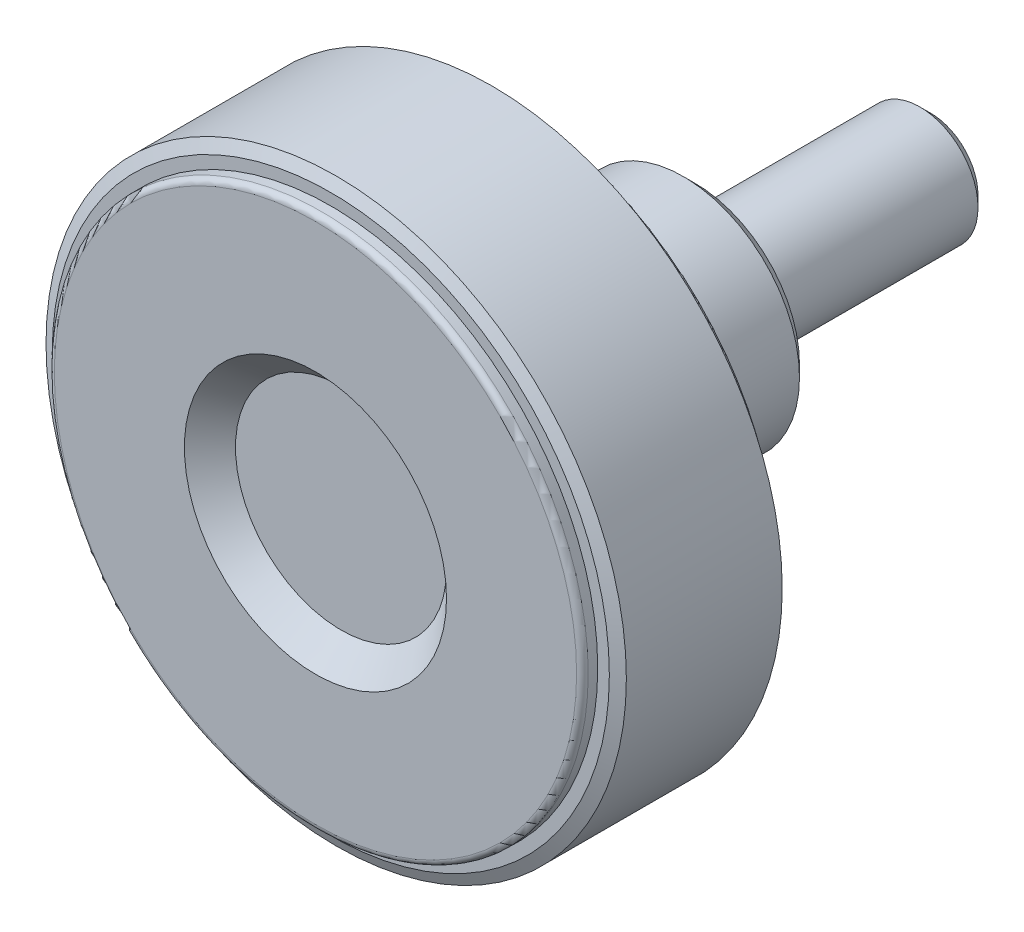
ISO-10303-21;
HEADER;
FILE_DESCRIPTION(('STEP AP214'),'2;1');
FILE_NAME('part.step','',(''),(''),'','','');
FILE_SCHEMA(('AUTOMOTIVE_DESIGN { 1 0 10303 214 1 1 1 1 }'));
ENDSEC;
DATA;
#1=APPLICATION_CONTEXT('core data for automotive mechanical design processes');
#2=APPLICATION_PROTOCOL_DEFINITION('international standard','automotive_design',2000,#1);
#3=PRODUCT_CONTEXT('',#1,'mechanical');
#4=PRODUCT('Part','Part','',(#3));
#5=PRODUCT_RELATED_PRODUCT_CATEGORY('part','',(#4));
#6=PRODUCT_DEFINITION_FORMATION('','',#4);
#7=PRODUCT_DEFINITION_CONTEXT('part definition',#1,'design');
#8=PRODUCT_DEFINITION('design','',#6,#7);
#9=PRODUCT_DEFINITION_SHAPE('','',#8);
#10=(LENGTH_UNIT() NAMED_UNIT(*) SI_UNIT(.MILLI.,.METRE.));
#11=(NAMED_UNIT(*) PLANE_ANGLE_UNIT() SI_UNIT($,.RADIAN.));
#12=(NAMED_UNIT(*) SI_UNIT($,.STERADIAN.) SOLID_ANGLE_UNIT());
#13=UNCERTAINTY_MEASURE_WITH_UNIT(LENGTH_MEASURE(1.E-05),#10,'distance_accuracy_value','');
#14=(GEOMETRIC_REPRESENTATION_CONTEXT(3) GLOBAL_UNCERTAINTY_ASSIGNED_CONTEXT((#13)) GLOBAL_UNIT_ASSIGNED_CONTEXT((#10,
#11,#12)) REPRESENTATION_CONTEXT('',''));
#15=CARTESIAN_POINT('',(0.,0.,0.));
#16=DIRECTION('',(0.,0.,1.));
#17=DIRECTION('',(1.,0.,0.));
#18=AXIS2_PLACEMENT_3D('',#15,#16,#17);
#19=CARTESIAN_POINT('',(0.,2.04,-20.));
#20=DIRECTION('',(0.,0.,-1.));
#21=DIRECTION('',(-1.,0.,0.));
#22=AXIS2_PLACEMENT_3D('',#19,#20,#21);
#23=PLANE('',#22);
#24=CARTESIAN_POINT('',(0.,0.,-19.9999999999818));
#25=DIRECTION('',(0.,0.,1.));
#26=DIRECTION('',(1.,0.,0.));
#27=AXIS2_PLACEMENT_3D('',#24,#25,#26);
#28=CIRCLE('',#27,4.07999999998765);
#29=CARTESIAN_POINT('',(4.07999999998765,0.,-19.9999999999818));
#30=VERTEX_POINT('',#29);
#31=EDGE_CURVE('E179',#30,#30,#28,.T.);
#32=ORIENTED_EDGE('',*,*,#31,.F.);
#33=EDGE_LOOP('',(#32));
#34=FACE_BOUND('',#33,.T.);
#35=ADVANCED_FACE('F14',(#34),#23,.T.);
#36=CARTESIAN_POINT('',(0.,0.,-19.0800000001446));
#37=DIRECTION('',(0.,0.,1.));
#38=DIRECTION('',(1.,0.,0.));
#39=AXIS2_PLACEMENT_3D('',#36,#37,#38);
#40=CONICAL_SURFACE('',#39,4.99999999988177,0.785398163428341);
#41=ORIENTED_EDGE('',*,*,#31,.T.);
#42=EDGE_LOOP('',(#41));
#43=FACE_BOUND('',#42,.T.);
#44=CARTESIAN_POINT('',(0.,0.,-19.08));
#45=DIRECTION('',(0.,0.,1.));
#46=DIRECTION('',(1.,0.,0.));
#47=AXIS2_PLACEMENT_3D('',#44,#45,#46);
#48=CIRCLE('',#47,5.);
#49=CARTESIAN_POINT('',(5.,0.,-19.08));
#50=VERTEX_POINT('',#49);
#51=EDGE_CURVE('E176',#50,#50,#48,.T.);
#52=ORIENTED_EDGE('',*,*,#51,.F.);
#53=EDGE_LOOP('',(#52));
#54=FACE_BOUND('',#53,.T.);
#55=ADVANCED_FACE('F536',(#43,#54),#40,.T.);
#56=CARTESIAN_POINT('',(0.,0.,-9.04));
#57=DIRECTION('',(0.,0.,1.));
#58=DIRECTION('',(1.,0.,0.));
#59=AXIS2_PLACEMENT_3D('',#56,#57,#58);
#60=CYLINDRICAL_SURFACE('',#59,5.);
#61=ORIENTED_EDGE('',*,*,#51,.T.);
#62=EDGE_LOOP('',(#61));
#63=FACE_BOUND('',#62,.T.);
#64=CARTESIAN_POINT('',(0.,0.,0.));
#65=DIRECTION('',(0.,0.,1.));
#66=DIRECTION('',(1.,0.,0.));
#67=AXIS2_PLACEMENT_3D('',#64,#65,#66);
#68=CIRCLE('',#67,5.);
#69=CARTESIAN_POINT('',(5.,0.,0.));
#70=VERTEX_POINT('',#69);
#71=EDGE_CURVE('E178',#70,#70,#68,.T.);
#72=ORIENTED_EDGE('',*,*,#71,.F.);
#73=EDGE_LOOP('',(#72));
#74=FACE_BOUND('',#73,.T.);
#75=ADVANCED_FACE('F526',(#63,#74),#60,.T.);
#76=CARTESIAN_POINT('',(0.,3.33333333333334,0.));
#77=DIRECTION('',(0.,0.,-1.));
#78=DIRECTION('',(-1.,0.,0.));
#79=AXIS2_PLACEMENT_3D('',#76,#77,#78);
#80=PLANE('',#79);
#81=CARTESIAN_POINT('',(0.,0.,0.));
#82=DIRECTION('',(0.,0.,1.));
#83=DIRECTION('',(1.,0.,0.));
#84=AXIS2_PLACEMENT_3D('',#81,#82,#83);
#85=CIRCLE('',#84,6.66666666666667);
#86=CARTESIAN_POINT('',(6.66666666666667,0.,0.));
#87=VERTEX_POINT('',#86);
#88=EDGE_CURVE('E211',#87,#87,#85,.T.);
#89=ORIENTED_EDGE('',*,*,#88,.F.);
#90=EDGE_LOOP('',(#89));
#91=FACE_BOUND('',#90,.T.);
#92=ORIENTED_EDGE('',*,*,#71,.T.);
#93=EDGE_LOOP('',(#92));
#94=FACE_BOUND('',#93,.T.);
#95=ADVANCED_FACE('F516',(#91,#94),#80,.T.);
#96=CARTESIAN_POINT('',(0.,0.,0.15));
#97=DIRECTION('',(0.,0.,1.));
#98=DIRECTION('',(1.,0.,0.));
#99=AXIS2_PLACEMENT_3D('',#96,#97,#98);
#100=CYLINDRICAL_SURFACE('',#99,6.66666666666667);
#101=ORIENTED_EDGE('',*,*,#88,.T.);
#102=EDGE_LOOP('',(#101));
#103=FACE_BOUND('',#102,.T.);
#104=CARTESIAN_POINT('',(0.,0.,0.3));
#105=DIRECTION('',(0.,0.,1.));
#106=DIRECTION('',(1.,0.,0.));
#107=AXIS2_PLACEMENT_3D('',#104,#105,#106);
#108=CIRCLE('',#107,6.66666666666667);
#109=CARTESIAN_POINT('',(6.66666666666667,0.,0.3));
#110=VERTEX_POINT('',#109);
#111=EDGE_CURVE('E208',#110,#110,#108,.T.);
#112=ORIENTED_EDGE('',*,*,#111,.F.);
#113=EDGE_LOOP('',(#112));
#114=FACE_BOUND('',#113,.T.);
#115=ADVANCED_FACE('F506',(#103,#114),#100,.T.);
#116=CARTESIAN_POINT('',(0.,7.83333333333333,0.3));
#117=DIRECTION('',(0.,0.,-1.));
#118=DIRECTION('',(-1.,0.,0.));
#119=AXIS2_PLACEMENT_3D('',#116,#117,#118);
#120=PLANE('',#119);
#121=CARTESIAN_POINT('',(0.,0.,0.3));
#122=DIRECTION('',(0.,0.,1.));
#123=DIRECTION('',(1.,0.,0.));
#124=AXIS2_PLACEMENT_3D('',#121,#122,#123);
#125=CIRCLE('',#124,9.);
#126=CARTESIAN_POINT('',(9.,0.,0.3));
#127=VERTEX_POINT('',#126);
#128=EDGE_CURVE('E175',#127,#127,#125,.T.);
#129=ORIENTED_EDGE('',*,*,#128,.F.);
#130=EDGE_LOOP('',(#129));
#131=FACE_BOUND('',#130,.T.);
#132=ORIENTED_EDGE('',*,*,#111,.T.);
#133=EDGE_LOOP('',(#132));
#134=FACE_BOUND('',#133,.T.);
#135=ADVANCED_FACE('F496',(#131,#134),#120,.T.);
#136=CARTESIAN_POINT('',(0.,0.,1.3));
#137=DIRECTION('',(0.,0.,1.));
#138=DIRECTION('',(1.,0.,0.));
#139=AXIS2_PLACEMENT_3D('',#136,#137,#138);
#140=CONICAL_SURFACE('',#139,10.,0.785398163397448);
#141=ORIENTED_EDGE('',*,*,#128,.T.);
#142=EDGE_LOOP('',(#141));
#143=FACE_BOUND('',#142,.T.);
#144=CARTESIAN_POINT('',(0.,0.,1.3));
#145=DIRECTION('',(0.,0.,1.));
#146=DIRECTION('',(1.,0.,0.));
#147=AXIS2_PLACEMENT_3D('',#144,#145,#146);
#148=CIRCLE('',#147,10.);
#149=CARTESIAN_POINT('',(10.,0.,1.3));
#150=VERTEX_POINT('',#149);
#151=EDGE_CURVE('E172',#150,#150,#148,.T.);
#152=ORIENTED_EDGE('',*,*,#151,.F.);
#153=EDGE_LOOP('',(#152));
#154=FACE_BOUND('',#153,.T.);
#155=ADVANCED_FACE('F487',(#143,#154),#140,.T.);
#156=CARTESIAN_POINT('',(0.,0.,13.9));
#157=DIRECTION('',(0.,0.,1.));
#158=DIRECTION('',(1.,0.,0.));
#159=AXIS2_PLACEMENT_3D('',#156,#157,#158);
#160=CYLINDRICAL_SURFACE('',#159,10.);
#161=ORIENTED_EDGE('',*,*,#151,.T.);
#162=EDGE_LOOP('',(#161));
#163=FACE_BOUND('',#162,.T.);
#164=CARTESIAN_POINT('',(0.,0.,26.5));
#165=DIRECTION('',(0.,0.,-1.));
#166=DIRECTION('',(-1.,0.,0.));
#167=AXIS2_PLACEMENT_3D('',#164,#165,#166);
#168=CIRCLE('',#167,10.);
#169=CARTESIAN_POINT('',(-10.,0.,26.5));
#170=VERTEX_POINT('',#169);
#171=EDGE_CURVE('E75',#170,#170,#168,.T.);
#172=ORIENTED_EDGE('',*,*,#171,.T.);
#173=EDGE_LOOP('',(#172));
#174=FACE_BOUND('',#173,.T.);
#175=ADVANCED_FACE('F482',(#163,#174),#160,.T.);
#176=CARTESIAN_POINT('',(0.,0.,26.5));
#177=DIRECTION('',(0.,0.,-1.));
#178=DIRECTION('',(-1.,0.,0.));
#179=AXIS2_PLACEMENT_3D('',#176,#177,#178);
#180=TOROIDAL_SURFACE('',#179,11.,1.);
#181=CARTESIAN_POINT('',(0.,0.,27.5));
#182=DIRECTION('',(0.,0.,-1.));
#183=DIRECTION('',(1.,0.,0.));
#184=AXIS2_PLACEMENT_3D('',#181,#182,#183);
#185=CIRCLE('',#184,11.);
#186=CARTESIAN_POINT('',(-11.,0.,27.5));
#187=VERTEX_POINT('',#186);
#188=CARTESIAN_POINT('',(11.,0.,27.5));
#189=VERTEX_POINT('',#188);
#190=EDGE_CURVE('E68',#187,#189,#185,.F.);
#191=ORIENTED_EDGE('',*,*,#190,.F.);
#192=CARTESIAN_POINT('',(0.,0.,27.5));
#193=DIRECTION('',(0.,0.,-1.));
#194=DIRECTION('',(-1.,0.,0.));
#195=AXIS2_PLACEMENT_3D('',#192,#193,#194);
#196=CIRCLE('',#195,11.);
#197=CARTESIAN_POINT('',(0.,11.,27.5));
#198=VERTEX_POINT('',#197);
#199=EDGE_CURVE('E71',#198,#187,#196,.F.);
#200=ORIENTED_EDGE('',*,*,#199,.F.);
#201=CARTESIAN_POINT('',(0.,0.,27.5));
#202=DIRECTION('',(0.,0.,-1.));
#203=DIRECTION('',(0.,1.,0.));
#204=AXIS2_PLACEMENT_3D('',#201,#202,#203);
#205=CIRCLE('',#204,11.);
#206=EDGE_CURVE('E63',#189,#198,#205,.F.);
#207=ORIENTED_EDGE('',*,*,#206,.F.);
#208=EDGE_LOOP('',(#191,#200,#207));
#209=FACE_BOUND('',#208,.T.);
#210=ORIENTED_EDGE('',*,*,#171,.F.);
#211=EDGE_LOOP('',(#210));
#212=FACE_BOUND('',#211,.T.);
#213=ADVANCED_FACE('F66',(#209,#212),#180,.F.);
#214=CARTESIAN_POINT('',(0.,14.6153846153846,27.5));
#215=DIRECTION('',(0.,0.,-1.));
#216=DIRECTION('',(-1.,0.,0.));
#217=AXIS2_PLACEMENT_3D('',#214,#215,#216);
#218=PLANE('',#217);
#219=CARTESIAN_POINT('',(0.,0.,27.5));
#220=DIRECTION('',(0.,0.,1.));
#221=DIRECTION('',(-1.,0.,0.));
#222=AXIS2_PLACEMENT_3D('',#219,#220,#221);
#223=CIRCLE('',#222,18.2307692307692);
#224=CARTESIAN_POINT('',(18.2307692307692,0.,27.5));
#225=VERTEX_POINT('',#224);
#226=CARTESIAN_POINT('',(-18.2307692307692,0.,27.5));
#227=VERTEX_POINT('',#226);
#228=EDGE_CURVE('E81',#225,#227,#223,.F.);
#229=ORIENTED_EDGE('',*,*,#228,.T.);
#230=CARTESIAN_POINT('',(0.,0.,27.5));
#231=DIRECTION('',(0.,0.,1.));
#232=DIRECTION('',(0.,1.,0.));
#233=AXIS2_PLACEMENT_3D('',#230,#231,#232);
#234=CIRCLE('',#233,18.2307692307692);
#235=CARTESIAN_POINT('',(0.,18.2307692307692,27.5));
#236=VERTEX_POINT('',#235);
#237=EDGE_CURVE('E130',#227,#236,#234,.F.);
#238=ORIENTED_EDGE('',*,*,#237,.T.);
#239=CARTESIAN_POINT('',(0.,0.,27.5));
#240=DIRECTION('',(0.,0.,1.));
#241=DIRECTION('',(1.,0.,0.));
#242=AXIS2_PLACEMENT_3D('',#239,#240,#241);
#243=CIRCLE('',#242,18.2307692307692);
#244=EDGE_CURVE('E143',#236,#225,#243,.F.);
#245=ORIENTED_EDGE('',*,*,#244,.T.);
#246=EDGE_LOOP('',(#229,#238,#245));
#247=FACE_BOUND('',#246,.T.);
#248=ORIENTED_EDGE('',*,*,#199,.T.);
#249=ORIENTED_EDGE('',*,*,#190,.T.);
#250=ORIENTED_EDGE('',*,*,#206,.T.);
#251=EDGE_LOOP('',(#248,#249,#250));
#252=FACE_BOUND('',#251,.T.);
#253=ADVANCED_FACE('F79',(#247,#252),#218,.T.);
#254=CARTESIAN_POINT('',(0.,0.,26.5));
#255=DIRECTION('',(0.,0.,-1.));
#256=DIRECTION('',(-1.,0.,0.));
#257=AXIS2_PLACEMENT_3D('',#254,#255,#256);
#258=TOROIDAL_SURFACE('',#257,18.2307692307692,1.);
#259=ORIENTED_EDGE('',*,*,#237,.F.);
#260=ORIENTED_EDGE('',*,*,#228,.F.);
#261=ORIENTED_EDGE('',*,*,#244,.F.);
#262=EDGE_LOOP('',(#259,#260,#261));
#263=FACE_BOUND('',#262,.T.);
#264=CARTESIAN_POINT('',(0.,0.,26.5));
#265=DIRECTION('',(0.,0.,1.));
#266=DIRECTION('',(1.,0.,0.));
#267=AXIS2_PLACEMENT_3D('',#264,#265,#266);
#268=CIRCLE('',#267,19.2307692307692);
#269=CARTESIAN_POINT('',(19.2307692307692,0.,26.5));
#270=VERTEX_POINT('',#269);
#271=EDGE_CURVE('E205',#270,#270,#268,.F.);
#272=ORIENTED_EDGE('',*,*,#271,.T.);
#273=EDGE_LOOP('',(#272));
#274=FACE_BOUND('',#273,.T.);
#275=ADVANCED_FACE('F100',(#263,#274),#258,.F.);
#276=CARTESIAN_POINT('',(0.,0.,21.25));
#277=DIRECTION('',(0.,0.,1.));
#278=DIRECTION('',(1.,0.,0.));
#279=AXIS2_PLACEMENT_3D('',#276,#277,#278);
#280=CYLINDRICAL_SURFACE('',#279,19.2307692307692);
#281=ORIENTED_EDGE('',*,*,#271,.F.);
#282=EDGE_LOOP('',(#281));
#283=FACE_BOUND('',#282,.T.);
#284=CARTESIAN_POINT('',(0.,0.,16.));
#285=DIRECTION('',(0.,0.,1.));
#286=DIRECTION('',(1.,0.,0.));
#287=AXIS2_PLACEMENT_3D('',#284,#285,#286);
#288=CIRCLE('',#287,19.2307692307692);
#289=CARTESIAN_POINT('',(19.2307692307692,0.,16.));
#290=VERTEX_POINT('',#289);
#291=EDGE_CURVE('E201',#290,#290,#288,.T.);
#292=ORIENTED_EDGE('',*,*,#291,.F.);
#293=EDGE_LOOP('',(#292));
#294=FACE_BOUND('',#293,.T.);
#295=ADVANCED_FACE('F329',(#283,#294),#280,.F.);
#296=CARTESIAN_POINT('',(0.,20.8653846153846,16.));
#297=DIRECTION('',(0.,0.,-1.));
#298=DIRECTION('',(-1.,0.,0.));
#299=AXIS2_PLACEMENT_3D('',#296,#297,#298);
#300=PLANE('',#299);
#301=CARTESIAN_POINT('',(0.,0.,16.));
#302=DIRECTION('',(0.,0.,1.));
#303=DIRECTION('',(-1.,0.,0.));
#304=AXIS2_PLACEMENT_3D('',#301,#302,#303);
#305=CIRCLE('',#304,22.5);
#306=CARTESIAN_POINT('',(-22.5,0.,16.));
#307=VERTEX_POINT('',#306);
#308=CARTESIAN_POINT('',(22.5,0.,16.));
#309=VERTEX_POINT('',#308);
#310=EDGE_CURVE('E264',#307,#309,#305,.T.);
#311=ORIENTED_EDGE('',*,*,#310,.F.);
#312=CARTESIAN_POINT('',(0.,0.,16.));
#313=DIRECTION('',(0.,0.,1.));
#314=DIRECTION('',(0.,1.,0.));
#315=AXIS2_PLACEMENT_3D('',#312,#313,#314);
#316=CIRCLE('',#315,22.5);
#317=CARTESIAN_POINT('',(0.,22.5,16.));
#318=VERTEX_POINT('',#317);
#319=EDGE_CURVE('E299',#318,#307,#316,.T.);
#320=ORIENTED_EDGE('',*,*,#319,.F.);
#321=CARTESIAN_POINT('',(0.,0.,16.));
#322=DIRECTION('',(0.,0.,1.));
#323=DIRECTION('',(1.,0.,0.));
#324=AXIS2_PLACEMENT_3D('',#321,#322,#323);
#325=CIRCLE('',#324,22.5);
#326=EDGE_CURVE('E204',#309,#318,#325,.T.);
#327=ORIENTED_EDGE('',*,*,#326,.F.);
#328=EDGE_LOOP('',(#311,#320,#327));
#329=FACE_BOUND('',#328,.T.);
#330=ORIENTED_EDGE('',*,*,#291,.T.);
#331=EDGE_LOOP('',(#330));
#332=FACE_BOUND('',#331,.T.);
#333=ADVANCED_FACE('F275',(#329,#332),#300,.T.);
#334=CARTESIAN_POINT('',(0.,0.,16.5));
#335=DIRECTION('',(0.,0.,-1.));
#336=DIRECTION('',(-1.,0.,0.));
#337=AXIS2_PLACEMENT_3D('',#334,#335,#336);
#338=TOROIDAL_SURFACE('',#337,22.5,0.5);
#339=ORIENTED_EDGE('',*,*,#319,.T.);
#340=ORIENTED_EDGE('',*,*,#310,.T.);
#341=ORIENTED_EDGE('',*,*,#326,.T.);
#342=EDGE_LOOP('',(#339,#340,#341));
#343=FACE_BOUND('',#342,.T.);
#344=CARTESIAN_POINT('',(0.,0.,16.5));
#345=DIRECTION('',(0.,0.,1.));
#346=DIRECTION('',(1.,0.,0.));
#347=AXIS2_PLACEMENT_3D('',#344,#345,#346);
#348=CIRCLE('',#347,23.);
#349=CARTESIAN_POINT('',(23.,0.,16.5));
#350=VERTEX_POINT('',#349);
#351=EDGE_CURVE('E200',#350,#350,#348,.T.);
#352=ORIENTED_EDGE('',*,*,#351,.F.);
#353=EDGE_LOOP('',(#352));
#354=FACE_BOUND('',#353,.T.);
#355=ADVANCED_FACE('F269',(#343,#354),#338,.T.);
#356=CARTESIAN_POINT('',(0.,0.,16.91));
#357=DIRECTION('',(0.,0.,1.));
#358=DIRECTION('',(1.,0.,0.));
#359=AXIS2_PLACEMENT_3D('',#356,#357,#358);
#360=CYLINDRICAL_SURFACE('',#359,23.);
#361=ORIENTED_EDGE('',*,*,#351,.T.);
#362=EDGE_LOOP('',(#361));
#363=FACE_BOUND('',#362,.T.);
#364=CARTESIAN_POINT('',(0.,0.,17.32));
#365=DIRECTION('',(0.,0.,1.));
#366=DIRECTION('',(1.,0.,0.));
#367=AXIS2_PLACEMENT_3D('',#364,#365,#366);
#368=CIRCLE('',#367,23.);
#369=CARTESIAN_POINT('',(23.,0.,17.32));
#370=VERTEX_POINT('',#369);
#371=EDGE_CURVE('E197',#370,#370,#368,.T.);
#372=ORIENTED_EDGE('',*,*,#371,.F.);
#373=EDGE_LOOP('',(#372));
#374=FACE_BOUND('',#373,.T.);
#375=ADVANCED_FACE('F274',(#363,#374),#360,.T.);
#376=CARTESIAN_POINT('',(0.,23.5,17.32));
#377=DIRECTION('',(0.,0.,-1.));
#378=DIRECTION('',(-1.,0.,0.));
#379=AXIS2_PLACEMENT_3D('',#376,#377,#378);
#380=PLANE('',#379);
#381=CARTESIAN_POINT('',(0.,0.,17.32));
#382=DIRECTION('',(0.,0.,1.));
#383=DIRECTION('',(1.,0.,0.));
#384=AXIS2_PLACEMENT_3D('',#381,#382,#383);
#385=CIRCLE('',#384,24.);
#386=CARTESIAN_POINT('',(24.,0.,17.32));
#387=VERTEX_POINT('',#386);
#388=EDGE_CURVE('E193',#387,#387,#385,.T.);
#389=ORIENTED_EDGE('',*,*,#388,.F.);
#390=EDGE_LOOP('',(#389));
#391=FACE_BOUND('',#390,.T.);
#392=ORIENTED_EDGE('',*,*,#371,.T.);
#393=EDGE_LOOP('',(#392));
#394=FACE_BOUND('',#393,.T.);
#395=ADVANCED_FACE('F342',(#391,#394),#380,.T.);
#396=CARTESIAN_POINT('',(0.,0.,17.786307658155));
#397=DIRECTION('',(0.,0.,1.));
#398=DIRECTION('',(1.,0.,0.));
#399=AXIS2_PLACEMENT_3D('',#396,#397,#398);
#400=CONICAL_SURFACE('',#399,25.,1.13446401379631);
#401=CARTESIAN_POINT('',(4.86721773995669E-13,1.73372427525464E-12,17.786307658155));
#402=DIRECTION('',(0.,0.,-1.));
#403=DIRECTION('',(-1.,0.,0.));
#404=AXIS2_PLACEMENT_3D('',#401,#402,#403);
#405=CIRCLE('',#404,24.9999999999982);
#406=CARTESIAN_POINT('',(-24.9999999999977,1.73372427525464E-12,17.786307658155));
#407=VERTEX_POINT('',#406);
#408=EDGE_CURVE('E196',#407,#407,#405,.F.);
#409=ORIENTED_EDGE('',*,*,#408,.F.);
#410=EDGE_LOOP('',(#409));
#411=FACE_BOUND('',#410,.T.);
#412=ORIENTED_EDGE('',*,*,#388,.T.);
#413=EDGE_LOOP('',(#412));
#414=FACE_BOUND('',#413,.T.);
#415=ADVANCED_FACE('F340',(#411,#414),#400,.T.);
#416=CARTESIAN_POINT('',(0.,4.54545454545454,30.8));
#417=DIRECTION('',(0.,0.,1.));
#418=DIRECTION('',(1.,0.,0.));
#419=AXIS2_PLACEMENT_3D('',#416,#417,#418);
#420=PLANE('',#419);
#421=CARTESIAN_POINT('',(0.,0.,30.8));
#422=DIRECTION('',(0.,0.,1.));
#423=DIRECTION('',(1.,0.,0.));
#424=AXIS2_PLACEMENT_3D('',#421,#422,#423);
#425=CIRCLE('',#424,9.0909090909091);
#426=CARTESIAN_POINT('',(9.0909090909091,0.,30.8));
#427=VERTEX_POINT('',#426);
#428=EDGE_CURVE('E181',#427,#427,#425,.T.);
#429=ORIENTED_EDGE('',*,*,#428,.T.);
#430=EDGE_LOOP('',(#429));
#431=FACE_BOUND('',#430,.T.);
#432=ADVANCED_FACE('F242',(#431),#420,.T.);
#433=CARTESIAN_POINT('',(0.,0.,33.));
#434=DIRECTION('',(0.,0.,1.));
#435=DIRECTION('',(1.,0.,0.));
#436=AXIS2_PLACEMENT_3D('',#433,#434,#435);
#437=CONICAL_SURFACE('',#436,11.2909090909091,0.785398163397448);
#438=CARTESIAN_POINT('',(0.,0.,33.));
#439=DIRECTION('',(0.,0.,1.));
#440=DIRECTION('',(1.,0.,0.));
#441=AXIS2_PLACEMENT_3D('',#438,#439,#440);
#442=CIRCLE('',#441,11.2909090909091);
#443=CARTESIAN_POINT('',(11.2909090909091,0.,33.));
#444=VERTEX_POINT('',#443);
#445=EDGE_CURVE('E9',#444,#444,#442,.F.);
#446=ORIENTED_EDGE('',*,*,#445,.F.);
#447=EDGE_LOOP('',(#446));
#448=FACE_BOUND('',#447,.T.);
#449=ORIENTED_EDGE('',*,*,#428,.F.);
#450=EDGE_LOOP('',(#449));
#451=FACE_BOUND('',#450,.T.);
#452=ADVANCED_FACE('F240',(#448,#451),#437,.F.);
#453=CARTESIAN_POINT('',(0.,16.8954545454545,33.));
#454=DIRECTION('',(0.,0.,1.));
#455=DIRECTION('',(1.,0.,0.));
#456=AXIS2_PLACEMENT_3D('',#453,#454,#455);
#457=PLANE('',#456);
#458=ORIENTED_EDGE('',*,*,#445,.T.);
#459=EDGE_LOOP('',(#458));
#460=FACE_BOUND('',#459,.T.);
#461=CARTESIAN_POINT('',(0.,0.,33.));
#462=DIRECTION('',(0.,0.,-1.));
#463=DIRECTION('',(-1.,0.,0.));
#464=AXIS2_PLACEMENT_3D('',#461,#462,#463);
#465=CIRCLE('',#464,22.5);
#466=CARTESIAN_POINT('',(0.,22.5,33.));
#467=VERTEX_POINT('',#466);
#468=CARTESIAN_POINT('',(-22.5,0.,33.));
#469=VERTEX_POINT('',#468);
#470=EDGE_CURVE('E219',#467,#469,#465,.F.);
#471=ORIENTED_EDGE('',*,*,#470,.T.);
#472=CARTESIAN_POINT('',(0.,0.,33.));
#473=DIRECTION('',(0.,0.,-1.));
#474=DIRECTION('',(1.,0.,0.));
#475=AXIS2_PLACEMENT_3D('',#472,#473,#474);
#476=CIRCLE('',#475,22.5);
#477=CARTESIAN_POINT('',(22.5,0.,33.));
#478=VERTEX_POINT('',#477);
#479=EDGE_CURVE('E23',#469,#478,#476,.F.);
#480=ORIENTED_EDGE('',*,*,#479,.T.);
#481=CARTESIAN_POINT('',(0.,0.,33.));
#482=DIRECTION('',(0.,0.,-1.));
#483=DIRECTION('',(0.,1.,0.));
#484=AXIS2_PLACEMENT_3D('',#481,#482,#483);
#485=CIRCLE('',#484,22.5);
#486=EDGE_CURVE('E184',#478,#467,#485,.F.);
#487=ORIENTED_EDGE('',*,*,#486,.T.);
#488=EDGE_LOOP('',(#471,#480,#487));
#489=FACE_BOUND('',#488,.T.);
#490=ADVANCED_FACE('F238',(#460,#489),#457,.T.);
#491=CARTESIAN_POINT('',(0.,0.,32.5));
#492=DIRECTION('',(0.,0.,-1.));
#493=DIRECTION('',(-1.,0.,0.));
#494=AXIS2_PLACEMENT_3D('',#491,#492,#493);
#495=TOROIDAL_SURFACE('',#494,22.5,0.5);
#496=CARTESIAN_POINT('',(0.,0.,32.5));
#497=DIRECTION('',(0.,0.,-1.));
#498=DIRECTION('',(-1.,0.,0.));
#499=AXIS2_PLACEMENT_3D('',#496,#497,#498);
#500=CIRCLE('',#499,23.);
#501=CARTESIAN_POINT('',(-23.,0.,32.5));
#502=VERTEX_POINT('',#501);
#503=EDGE_CURVE('E185',#502,#502,#500,.F.);
#504=ORIENTED_EDGE('',*,*,#503,.T.);
#505=EDGE_LOOP('',(#504));
#506=FACE_BOUND('',#505,.T.);
#507=ORIENTED_EDGE('',*,*,#479,.F.);
#508=ORIENTED_EDGE('',*,*,#470,.F.);
#509=ORIENTED_EDGE('',*,*,#486,.F.);
#510=EDGE_LOOP('',(#507,#508,#509));
#511=FACE_BOUND('',#510,.T.);
#512=ADVANCED_FACE('F226',(#506,#511),#495,.T.);
#513=CARTESIAN_POINT('',(0.,0.,32.09));
#514=DIRECTION('',(0.,0.,1.));
#515=DIRECTION('',(1.,0.,0.));
#516=AXIS2_PLACEMENT_3D('',#513,#514,#515);
#517=CYLINDRICAL_SURFACE('',#516,23.);
#518=ORIENTED_EDGE('',*,*,#503,.F.);
#519=EDGE_LOOP('',(#518));
#520=FACE_BOUND('',#519,.T.);
#521=CARTESIAN_POINT('',(0.,0.,31.68));
#522=DIRECTION('',(0.,0.,1.));
#523=DIRECTION('',(1.,0.,0.));
#524=AXIS2_PLACEMENT_3D('',#521,#522,#523);
#525=CIRCLE('',#524,23.);
#526=CARTESIAN_POINT('',(23.,0.,31.68));
#527=VERTEX_POINT('',#526);
#528=EDGE_CURVE('E186',#527,#527,#525,.T.);
#529=ORIENTED_EDGE('',*,*,#528,.T.);
#530=EDGE_LOOP('',(#529));
#531=FACE_BOUND('',#530,.T.);
#532=ADVANCED_FACE('F237',(#520,#531),#517,.T.);
#533=CARTESIAN_POINT('',(0.,0.,31.213692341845));
#534=DIRECTION('',(0.,0.,-1.));
#535=DIRECTION('',(-1.,0.,0.));
#536=AXIS2_PLACEMENT_3D('',#533,#534,#535);
#537=CONICAL_SURFACE('',#536,25.,1.13446401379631);
#538=CARTESIAN_POINT('',(0.,0.,31.68));
#539=DIRECTION('',(0.,0.,-1.));
#540=DIRECTION('',(-1.,0.,0.));
#541=AXIS2_PLACEMENT_3D('',#538,#539,#540);
#542=CIRCLE('',#541,24.);
#543=CARTESIAN_POINT('',(-24.,0.,31.68));
#544=VERTEX_POINT('',#543);
#545=EDGE_CURVE('E189',#544,#544,#542,.F.);
#546=ORIENTED_EDGE('',*,*,#545,.F.);
#547=EDGE_LOOP('',(#546));
#548=FACE_BOUND('',#547,.T.);
#549=CARTESIAN_POINT('',(0.,0.,31.213692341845));
#550=DIRECTION('',(0.,0.,-1.));
#551=DIRECTION('',(0.,1.,0.));
#552=AXIS2_PLACEMENT_3D('',#549,#550,#551);
#553=CIRCLE('',#552,25.);
#554=CARTESIAN_POINT('',(0.,25.,31.213692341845));
#555=VERTEX_POINT('',#554);
#556=EDGE_CURVE('E192',#555,#555,#553,.F.);
#557=ORIENTED_EDGE('',*,*,#556,.T.);
#558=EDGE_LOOP('',(#557));
#559=FACE_BOUND('',#558,.T.);
#560=ADVANCED_FACE('F360',(#548,#559),#537,.T.);
#561=CARTESIAN_POINT('',(0.,23.5,31.68));
#562=DIRECTION('',(0.,0.,1.));
#563=DIRECTION('',(1.,0.,0.));
#564=AXIS2_PLACEMENT_3D('',#561,#562,#563);
#565=PLANE('',#564);
#566=ORIENTED_EDGE('',*,*,#528,.F.);
#567=EDGE_LOOP('',(#566));
#568=FACE_BOUND('',#567,.T.);
#569=ORIENTED_EDGE('',*,*,#545,.T.);
#570=EDGE_LOOP('',(#569));
#571=FACE_BOUND('',#570,.T.);
#572=ADVANCED_FACE('F358',(#568,#571),#565,.T.);
#573=CARTESIAN_POINT('',(4.86721773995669E-13,1.73372427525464E-12,0.));
#574=DIRECTION('',(0.,0.,-1.));
#575=DIRECTION('',(-1.,0.,0.));
#576=AXIS2_PLACEMENT_3D('',#573,#574,#575);
#577=CYLINDRICAL_SURFACE('',#576,24.9999999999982);
#578=ORIENTED_EDGE('',*,*,#408,.T.);
#579=EDGE_LOOP('',(#578));
#580=FACE_BOUND('',#579,.T.);
#581=ORIENTED_EDGE('',*,*,#556,.F.);
#582=EDGE_LOOP('',(#581));
#583=FACE_BOUND('',#582,.T.);
#584=ADVANCED_FACE('F355',(#580,#583),#577,.T.);
#585=CLOSED_SHELL('',(#35,#55,#75,#95,#115,#135,#155,#175,#213,#253,#275,#295,#333,#355,#375,
#395,#415,#432,#452,#490,#512,#532,#560,#572,#584));
#586=MANIFOLD_SOLID_BREP('B1',#585);
#587=ADVANCED_BREP_SHAPE_REPRESENTATION('',(#18,#586),#14);
#588=SHAPE_DEFINITION_REPRESENTATION(#9,#587);
ENDSEC;
END-ISO-10303-21;
